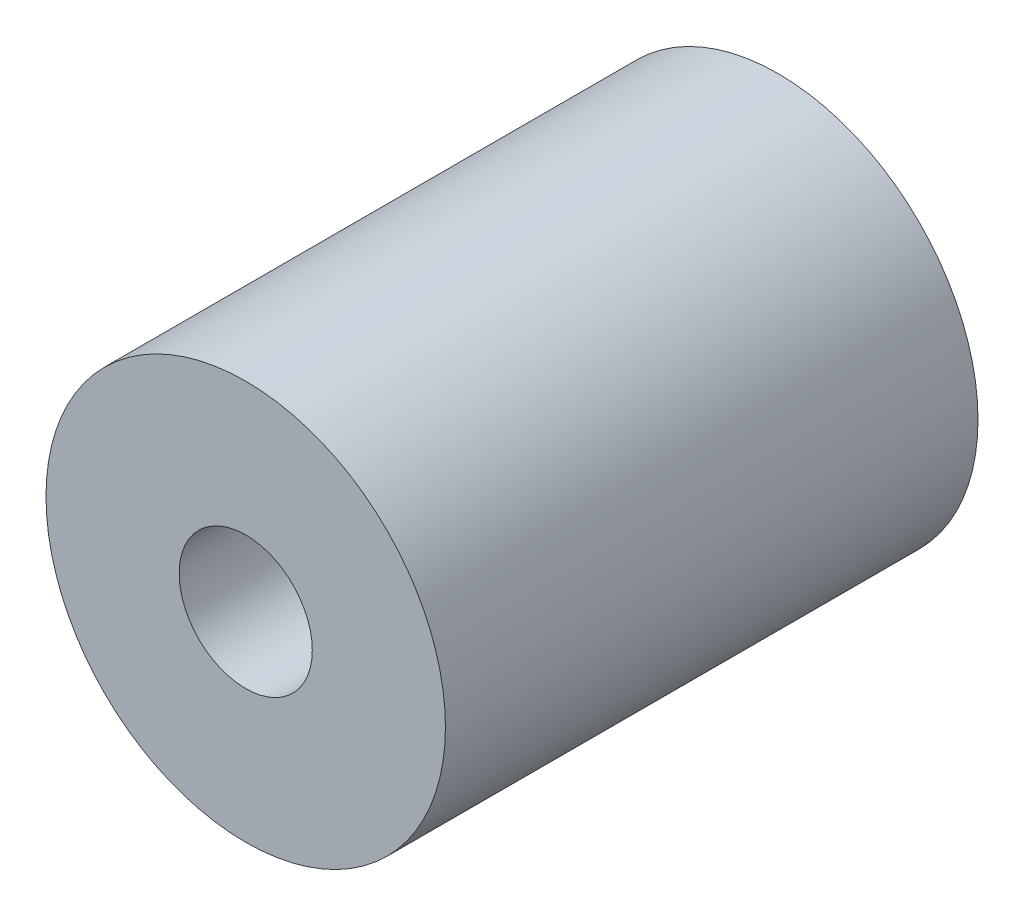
from build123d import *

# Parameters (mm, degrees)
SKETCH1_R                      = 3
BOSS_EXTRUDE1_DEPTH            = 4
DISPLACER_ROD_GUIDE_DEPTH      = 6.830951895
DISPLACER_ROD_GUIDE_DEPTH_BACK = 6.830951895
SKETCH3_R                      = 1


with BuildPart() as part:
    # Sketch1 → Boss-Extrude1 (new, symmetric)
    with BuildSketch(Plane.XY):
        Circle(SKETCH1_R)
    extrude(amount=BOSS_EXTRUDE1_DEPTH, both=True)

    # Sketch3 → displacer rod guide (cut, two sides: drawn at the far end of the back side and taken through both)
    with BuildSketch(Plane.XY.offset(-DISPLACER_ROD_GUIDE_DEPTH_BACK)):
        Circle(SKETCH3_R)
    extrude(amount=DISPLACER_ROD_GUIDE_DEPTH + DISPLACER_ROD_GUIDE_DEPTH_BACK, mode=Mode.SUBTRACT)


solid = part.part
